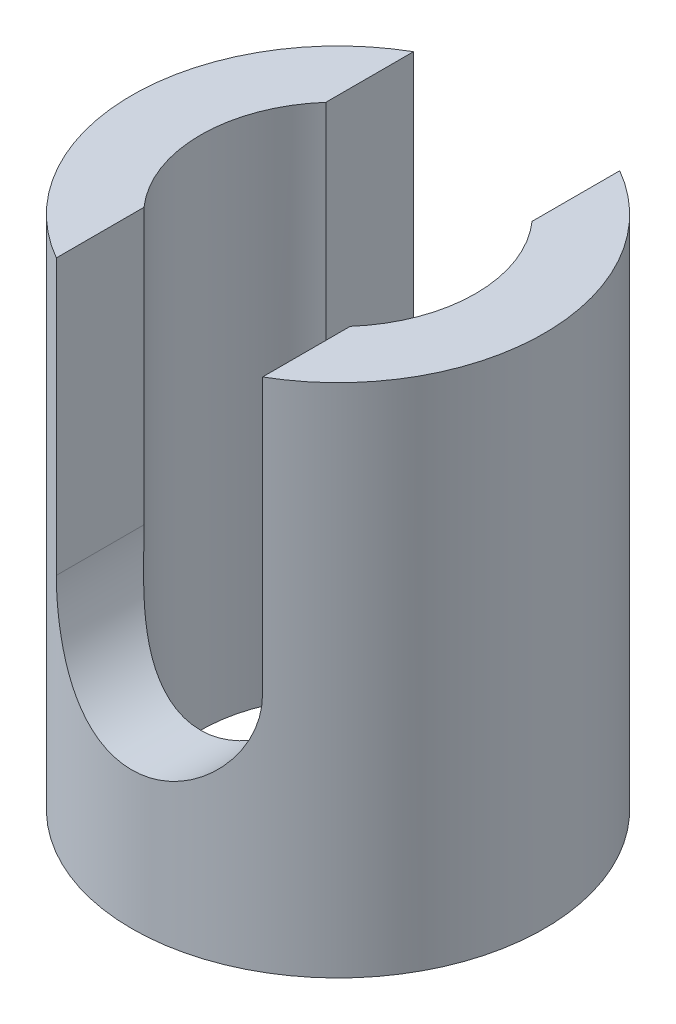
ISO-10303-21;
HEADER;
FILE_DESCRIPTION(('STEP AP214'),'2;1');
FILE_NAME('part.step','',(''),(''),'','','');
FILE_SCHEMA(('AUTOMOTIVE_DESIGN { 1 0 10303 214 1 1 1 1 }'));
ENDSEC;
DATA;
#1=APPLICATION_CONTEXT('core data for automotive mechanical design processes');
#2=APPLICATION_PROTOCOL_DEFINITION('international standard','automotive_design',2000,#1);
#3=PRODUCT_CONTEXT('',#1,'mechanical');
#4=PRODUCT('Part','Part','',(#3));
#5=PRODUCT_RELATED_PRODUCT_CATEGORY('part','',(#4));
#6=PRODUCT_DEFINITION_FORMATION('','',#4);
#7=PRODUCT_DEFINITION_CONTEXT('part definition',#1,'design');
#8=PRODUCT_DEFINITION('design','',#6,#7);
#9=PRODUCT_DEFINITION_SHAPE('','',#8);
#10=(LENGTH_UNIT() NAMED_UNIT(*) SI_UNIT(.MILLI.,.METRE.));
#11=(NAMED_UNIT(*) PLANE_ANGLE_UNIT() SI_UNIT($,.RADIAN.));
#12=(NAMED_UNIT(*) SI_UNIT($,.STERADIAN.) SOLID_ANGLE_UNIT());
#13=UNCERTAINTY_MEASURE_WITH_UNIT(LENGTH_MEASURE(1.E-05),#10,'distance_accuracy_value','');
#14=(GEOMETRIC_REPRESENTATION_CONTEXT(3) GLOBAL_UNCERTAINTY_ASSIGNED_CONTEXT((#13)) GLOBAL_UNIT_ASSIGNED_CONTEXT((#10,
#11,#12)) REPRESENTATION_CONTEXT('',''));
#15=CARTESIAN_POINT('',(0.,0.,0.));
#16=DIRECTION('',(0.,0.,1.));
#17=DIRECTION('',(1.,0.,0.));
#18=AXIS2_PLACEMENT_3D('',#15,#16,#17);
#19=CARTESIAN_POINT('',(0.,75.,0.));
#20=DIRECTION('',(0.,1.,0.));
#21=DIRECTION('',(0.,0.,1.));
#22=AXIS2_PLACEMENT_3D('',#19,#20,#21);
#23=PLANE('',#22);
#24=DIRECTION('',(0.,0.,1.));
#25=VECTOR('',#24,1.);
#26=CARTESIAN_POINT('',(15.,75.,-45.));
#27=LINE('',#26,#25);
#28=CARTESIAN_POINT('',(15.,75.,13.2287565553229));
#29=VERTEX_POINT('',#28);
#30=CARTESIAN_POINT('',(15.,75.,25.9807621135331));
#31=VERTEX_POINT('',#30);
#32=EDGE_CURVE('E269',#29,#31,#27,.T.);
#33=ORIENTED_EDGE('',*,*,#32,.T.);
#34=CARTESIAN_POINT('',(0.,75.,0.));
#35=DIRECTION('',(0.,1.,0.));
#36=DIRECTION('',(0.,0.,1.));
#37=AXIS2_PLACEMENT_3D('',#34,#35,#36);
#38=CIRCLE('',#37,30.);
#39=CARTESIAN_POINT('',(15.,75.,-25.9807621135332));
#40=VERTEX_POINT('',#39);
#41=EDGE_CURVE('E117',#31,#40,#38,.T.);
#42=ORIENTED_EDGE('',*,*,#41,.T.);
#43=CARTESIAN_POINT('',(15.,75.,-13.228756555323));
#44=VERTEX_POINT('',#43);
#45=EDGE_CURVE('E273',#40,#44,#27,.T.);
#46=ORIENTED_EDGE('',*,*,#45,.T.);
#47=CARTESIAN_POINT('',(0.,75.,0.));
#48=DIRECTION('',(0.,1.,0.));
#49=DIRECTION('',(0.,0.,1.));
#50=AXIS2_PLACEMENT_3D('',#47,#48,#49);
#51=CIRCLE('',#50,20.);
#52=EDGE_CURVE('E123',#29,#44,#51,.T.);
#53=ORIENTED_EDGE('',*,*,#52,.F.);
#54=EDGE_LOOP('',(#33,#42,#46,#53));
#55=FACE_BOUND('',#54,.T.);
#56=ADVANCED_FACE('F30',(#55),#23,.T.);
#57=DIRECTION('',(0.,0.,1.));
#58=VECTOR('',#57,1.);
#59=CARTESIAN_POINT('',(-15.,75.,-45.));
#60=LINE('',#59,#58);
#61=CARTESIAN_POINT('',(-15.,75.,-25.9807621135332));
#62=VERTEX_POINT('',#61);
#63=CARTESIAN_POINT('',(-15.,75.,-13.2287565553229));
#64=VERTEX_POINT('',#63);
#65=EDGE_CURVE('E54',#62,#64,#60,.T.);
#66=ORIENTED_EDGE('',*,*,#65,.F.);
#67=CARTESIAN_POINT('',(-15.,75.,25.9807621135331));
#68=VERTEX_POINT('',#67);
#69=EDGE_CURVE('E109',#62,#68,#38,.T.);
#70=ORIENTED_EDGE('',*,*,#69,.T.);
#71=CARTESIAN_POINT('',(-15.,75.,13.2287565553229));
#72=VERTEX_POINT('',#71);
#73=EDGE_CURVE('E112',#72,#68,#60,.T.);
#74=ORIENTED_EDGE('',*,*,#73,.F.);
#75=EDGE_CURVE('E111',#64,#72,#51,.T.);
#76=ORIENTED_EDGE('',*,*,#75,.F.);
#77=EDGE_LOOP('',(#66,#70,#74,#76));
#78=FACE_BOUND('',#77,.T.);
#79=ADVANCED_FACE('F107',(#78),#23,.T.);
#80=CARTESIAN_POINT('',(0.,0.,0.));
#81=DIRECTION('',(0.,1.,0.));
#82=DIRECTION('',(0.,0.,1.));
#83=AXIS2_PLACEMENT_3D('',#80,#81,#82);
#84=PLANE('',#83);
#85=CARTESIAN_POINT('',(0.,0.,0.));
#86=DIRECTION('',(0.,1.,0.));
#87=DIRECTION('',(0.,0.,1.));
#88=AXIS2_PLACEMENT_3D('',#85,#86,#87);
#89=CIRCLE('',#88,30.);
#90=CARTESIAN_POINT('',(0.,0.,30.));
#91=VERTEX_POINT('',#90);
#92=EDGE_CURVE('E118',#91,#91,#89,.T.);
#93=ORIENTED_EDGE('',*,*,#92,.F.);
#94=EDGE_LOOP('',(#93));
#95=FACE_BOUND('',#94,.T.);
#96=CARTESIAN_POINT('',(0.,0.,0.));
#97=DIRECTION('',(0.,1.,0.));
#98=DIRECTION('',(0.,0.,1.));
#99=AXIS2_PLACEMENT_3D('',#96,#97,#98);
#100=CIRCLE('',#99,20.);
#101=CARTESIAN_POINT('',(0.,0.,20.));
#102=VERTEX_POINT('',#101);
#103=EDGE_CURVE('E126',#102,#102,#100,.T.);
#104=ORIENTED_EDGE('',*,*,#103,.T.);
#105=EDGE_LOOP('',(#104));
#106=FACE_BOUND('',#105,.T.);
#107=ADVANCED_FACE('F182',(#95,#106),#84,.F.);
#108=CARTESIAN_POINT('',(0.,75.,0.));
#109=DIRECTION('',(0.,-1.,0.));
#110=DIRECTION('',(0.,0.,-1.));
#111=AXIS2_PLACEMENT_3D('',#108,#109,#110);
#112=CYLINDRICAL_SURFACE('',#111,30.);
#113=CARTESIAN_POINT('',(-15.,35.,-25.9807621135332));
#114=CARTESIAN_POINT('',(-15.0000014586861,34.8035788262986,-25.9807576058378));
#115=CARTESIAN_POINT('',(-14.9961410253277,34.6071854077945,-25.9829905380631));
#116=CARTESIAN_POINT('',(-14.9807217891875,34.2148095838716,-25.9918850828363));
#117=CARTESIAN_POINT('',(-14.96916331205,34.0188271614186,-25.9985465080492));
#118=CARTESIAN_POINT('',(-14.9230045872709,33.4323368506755,-26.0250894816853));
#119=CARTESIAN_POINT('',(-14.8769209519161,33.0429511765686,-26.0515298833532));
#120=CARTESIAN_POINT('',(-14.7551046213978,32.2727063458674,-26.1207142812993));
#121=CARTESIAN_POINT('',(-14.6795433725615,31.891811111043,-26.1633639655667));
#122=CARTESIAN_POINT('',(-14.4996932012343,31.1388163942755,-26.2634626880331));
#123=CARTESIAN_POINT('',(-14.3954009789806,30.7667179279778,-26.3209134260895));
#124=CARTESIAN_POINT('',(-14.1594990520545,30.0344949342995,-26.4485633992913));
#125=CARTESIAN_POINT('',(-14.0279498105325,29.6743459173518,-26.518734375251));
#126=CARTESIAN_POINT('',(-13.7386324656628,28.9670930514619,-26.6697691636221));
#127=CARTESIAN_POINT('',(-13.5808646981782,28.6199890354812,-26.7506328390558));
#128=CARTESIAN_POINT('',(-13.2401344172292,27.939995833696,-26.9209053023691));
#129=CARTESIAN_POINT('',(-13.0571396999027,27.607125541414,-27.0103249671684));
#130=CARTESIAN_POINT('',(-12.667252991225,26.9573433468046,-27.1953538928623));
#131=CARTESIAN_POINT('',(-12.4603522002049,26.640437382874,-27.2909654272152));
#132=CARTESIAN_POINT('',(-12.0060202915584,25.9987571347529,-27.4940416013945));
#133=CARTESIAN_POINT('',(-11.7566593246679,25.6754524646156,-27.6018366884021));
#134=CARTESIAN_POINT('',(-11.2327527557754,25.0505512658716,-27.819160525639));
#135=CARTESIAN_POINT('',(-10.9582058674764,24.7489558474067,-27.9286893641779));
#136=CARTESIAN_POINT('',(-10.3851551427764,24.1688018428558,-28.14680386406));
#137=CARTESIAN_POINT('',(-10.0866411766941,23.8902530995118,-28.2553891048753));
#138=CARTESIAN_POINT('',(-9.46725117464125,23.3579273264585,-28.4689028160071));
#139=CARTESIAN_POINT('',(-9.14638268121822,23.1041420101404,-28.5738325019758));
#140=CARTESIAN_POINT('',(-8.46116294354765,22.6064548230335,-28.7844701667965));
#141=CARTESIAN_POINT('',(-8.09533855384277,22.3643930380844,-28.8897475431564));
#142=CARTESIAN_POINT('',(-7.34182448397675,21.912193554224,-29.0903697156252));
#143=CARTESIAN_POINT('',(-6.95413354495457,21.7020576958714,-29.1857139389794));
#144=CARTESIAN_POINT('',(-6.15953553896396,21.315880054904,-29.3636813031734));
#145=CARTESIAN_POINT('',(-5.75263775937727,21.1398219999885,-29.4463105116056));
#146=CARTESIAN_POINT('',(-4.92239251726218,20.82370659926,-29.5964174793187));
#147=CARTESIAN_POINT('',(-4.49904680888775,20.6836454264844,-29.663896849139));
#148=CARTESIAN_POINT('',(-3.66992752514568,20.4499577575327,-29.7774087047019));
#149=CARTESIAN_POINT('',(-3.2650467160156,20.3537365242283,-29.8246255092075));
#150=CARTESIAN_POINT('',(-2.4471632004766,20.1951063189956,-29.9028443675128));
#151=CARTESIAN_POINT('',(-2.03416084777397,20.1326958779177,-29.9338471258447));
#152=CARTESIAN_POINT('',(-1.20366828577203,20.0425415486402,-29.9787263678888));
#153=CARTESIAN_POINT('',(-0.786180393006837,20.0147805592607,-29.9926113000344));
#154=CARTESIAN_POINT('',(0.0498593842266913,19.9942569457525,-30.0028704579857));
#155=CARTESIAN_POINT('',(0.468411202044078,20.0014921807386,-29.999245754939));
#156=CARTESIAN_POINT('',(1.26655168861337,20.0486961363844,-29.9756757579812));
#157=CARTESIAN_POINT('',(1.64635933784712,20.0857594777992,-29.9571791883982));
#158=CARTESIAN_POINT('',(2.40109782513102,20.1885262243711,-29.9061492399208));
#159=CARTESIAN_POINT('',(2.77602900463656,20.254227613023,-29.8736168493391));
#160=CARTESIAN_POINT('',(3.51848760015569,20.4135535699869,-29.7952951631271));
#161=CARTESIAN_POINT('',(3.88601491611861,20.5071785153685,-29.749505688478));
#162=CARTESIAN_POINT('',(4.61135394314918,20.7213995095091,-29.6457358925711));
#163=CARTESIAN_POINT('',(4.96916530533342,20.8419965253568,-29.5877551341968));
#164=CARTESIAN_POINT('',(5.67784399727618,21.110878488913,-29.4600324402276));
#165=CARTESIAN_POINT('',(6.02854798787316,21.2595216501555,-29.3901396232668));
#166=CARTESIAN_POINT('',(6.71596535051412,21.5821024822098,-29.2407172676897));
#167=CARTESIAN_POINT('',(7.05267873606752,21.7560401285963,-29.1611877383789));
#168=CARTESIAN_POINT('',(7.7105448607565,22.1279259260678,-28.9941837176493));
#169=CARTESIAN_POINT('',(8.03169592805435,22.3258766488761,-28.9067083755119));
#170=CARTESIAN_POINT('',(8.65712479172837,22.7445573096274,-28.725602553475));
#171=CARTESIAN_POINT('',(8.9613959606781,22.9652960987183,-28.6319696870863));
#172=CARTESIAN_POINT('',(9.57956834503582,23.4500925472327,-28.4314467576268));
#173=CARTESIAN_POINT('',(9.89167201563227,23.7162722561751,-28.3241391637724));
#174=CARTESIAN_POINT('',(10.4926149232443,24.2728021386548,-28.1070653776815));
#175=CARTESIAN_POINT('',(10.7814528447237,24.5631536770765,-27.9972990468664));
#176=CARTESIAN_POINT('',(11.3347011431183,25.16677644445,-27.7779260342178));
#177=CARTESIAN_POINT('',(11.5990922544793,25.4800654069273,-27.6683195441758));
#178=CARTESIAN_POINT('',(12.1018557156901,26.1279508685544,-27.4521400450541));
#179=CARTESIAN_POINT('',(12.3402233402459,26.4625512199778,-27.3455675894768));
#180=CARTESIAN_POINT('',(12.8039610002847,27.1737482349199,-27.1316776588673));
#181=CARTESIAN_POINT('',(13.0275001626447,27.5516616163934,-27.0247557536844));
#182=CARTESIAN_POINT('',(13.4414723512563,28.3276622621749,-26.8212607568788));
#183=CARTESIAN_POINT('',(13.6319207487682,28.7257400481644,-26.7246828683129));
#184=CARTESIAN_POINT('',(13.977598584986,29.5390802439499,-26.5455193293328));
#185=CARTESIAN_POINT('',(14.1328910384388,29.954310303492,-26.4629087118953));
#186=CARTESIAN_POINT('',(14.4067274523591,30.7995998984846,-26.3148344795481));
#187=CARTESIAN_POINT('',(14.5252873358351,31.2296529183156,-26.2493634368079));
#188=CARTESIAN_POINT('',(14.686571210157,31.9369371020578,-26.1593117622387));
#189=CARTESIAN_POINT('',(14.7410435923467,32.210774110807,-26.1286151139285));
#190=CARTESIAN_POINT('',(14.8347061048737,32.7617981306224,-26.0755516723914));
#191=CARTESIAN_POINT('',(14.8739004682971,33.0389841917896,-26.0531825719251));
#192=CARTESIAN_POINT('',(14.9367976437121,33.5961564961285,-26.0171763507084));
#193=CARTESIAN_POINT('',(14.9604736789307,33.8761467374,-26.0035543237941));
#194=CARTESIAN_POINT('',(14.9920878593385,34.4374199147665,-25.9853296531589));
#195=CARTESIAN_POINT('',(15.000019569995,34.7187033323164,-25.9807306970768));
#196=CARTESIAN_POINT('',(15.,35.,-25.9807621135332));
#197=B_SPLINE_CURVE_WITH_KNOTS('',3,(#113,#114,#115,#116,#117,#118,#119,#120,#121,#122,#123,
#124,#125,#126,#127,#128,#129,#130,#131,#132,#133,#134,#135,#136,#137,#138,#139,#140,#141,#142,
#143,#144,#145,#146,#147,#148,#149,#150,#151,#152,#153,#154,#155,#156,#157,#158,#159,#160,#161,
#162,#163,#164,#165,#166,#167,#168,#169,#170,#171,#172,#173,#174,#175,#176,#177,#178,#179,#180,
#181,#182,#183,#184,#185,#186,#187,#188,#189,#190,#191,#192,#193,#194,#195,#196),.UNSPECIFIED.,
.F.,.F.,(4,2,2,2,2,2,2,2,2,2,2,2,2,2,2,2,2,2,2,2,2,2,2,2,2,2,2,2,2,2,2,2,2,2,2,2,2,2,2,2,2,4),
(0.,0.589158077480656,1.17829123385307,2.3555570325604,3.5260753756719,4.69672820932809,
5.86481151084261,7.03287985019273,8.20245335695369,9.37245875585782,10.6379774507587,
11.9035608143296,13.1696819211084,14.4353778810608,15.7869844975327,17.1386690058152,
18.4897064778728,19.8406002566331,21.0953807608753,22.350106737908,23.6042132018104,
24.858242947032,26.0030687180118,27.1478138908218,28.2925745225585,29.4373762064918,
30.5979332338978,31.7584891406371,32.9191694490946,34.0803022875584,35.3509282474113,
36.6216260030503,37.8933167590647,39.1652380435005,40.5192232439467,41.8725778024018,
43.2234870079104,44.5738097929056,45.4159682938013,46.2578932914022,47.101267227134,
47.9449857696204),.UNSPECIFIED.);
#198=CARTESIAN_POINT('',(-15.,35.,-25.9807621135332));
#199=VERTEX_POINT('',#198);
#200=CARTESIAN_POINT('',(15.,35.,-25.9807621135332));
#201=VERTEX_POINT('',#200);
#202=EDGE_CURVE('E101',#199,#201,#197,.T.);
#203=ORIENTED_EDGE('',*,*,#202,.T.);
#204=DIRECTION('',(0.,-1.,0.));
#205=VECTOR('',#204,1.);
#206=CARTESIAN_POINT('',(15.,75.,-25.9807621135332));
#207=LINE('',#206,#205);
#208=EDGE_CURVE('E168',#201,#40,#207,.F.);
#209=ORIENTED_EDGE('',*,*,#208,.T.);
#210=ORIENTED_EDGE('',*,*,#41,.F.);
#211=DIRECTION('',(0.,-1.,0.));
#212=VECTOR('',#211,1.);
#213=CARTESIAN_POINT('',(15.,75.,25.9807621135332));
#214=LINE('',#213,#212);
#215=CARTESIAN_POINT('',(15.,35.,25.9807621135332));
#216=VERTEX_POINT('',#215);
#217=EDGE_CURVE('E171',#31,#216,#214,.T.);
#218=ORIENTED_EDGE('',*,*,#217,.T.);
#219=CARTESIAN_POINT('',(15.,35.,25.9807621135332));
#220=CARTESIAN_POINT('',(15.0000014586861,34.8035788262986,25.9807576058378));
#221=CARTESIAN_POINT('',(14.9961410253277,34.6071854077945,25.9829905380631));
#222=CARTESIAN_POINT('',(14.9807217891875,34.2148095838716,25.9918850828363));
#223=CARTESIAN_POINT('',(14.96916331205,34.0188271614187,25.9985465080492));
#224=CARTESIAN_POINT('',(14.9230045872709,33.4323368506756,26.0250894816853));
#225=CARTESIAN_POINT('',(14.8769209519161,33.0429511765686,26.0515298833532));
#226=CARTESIAN_POINT('',(14.7551046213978,32.2727063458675,26.1207142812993));
#227=CARTESIAN_POINT('',(14.6795433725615,31.891811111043,26.1633639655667));
#228=CARTESIAN_POINT('',(14.4996932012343,31.1388163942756,26.2634626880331));
#229=CARTESIAN_POINT('',(14.3954009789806,30.7667179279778,26.3209134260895));
#230=CARTESIAN_POINT('',(14.1594990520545,30.0344949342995,26.4485633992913));
#231=CARTESIAN_POINT('',(14.0279498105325,29.6743459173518,26.518734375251));
#232=CARTESIAN_POINT('',(13.7386324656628,28.9670930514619,26.6697691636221));
#233=CARTESIAN_POINT('',(13.5808646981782,28.6199890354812,26.7506328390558));
#234=CARTESIAN_POINT('',(13.2401344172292,27.939995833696,26.9209053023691));
#235=CARTESIAN_POINT('',(13.0571396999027,27.607125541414,27.0103249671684));
#236=CARTESIAN_POINT('',(12.6672529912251,26.9573433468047,27.1953538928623));
#237=CARTESIAN_POINT('',(12.4603522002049,26.6404373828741,27.2909654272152));
#238=CARTESIAN_POINT('',(12.0060202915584,25.9987571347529,27.4940416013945));
#239=CARTESIAN_POINT('',(11.7566593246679,25.6754524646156,27.6018366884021));
#240=CARTESIAN_POINT('',(11.2327527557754,25.0505512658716,27.819160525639));
#241=CARTESIAN_POINT('',(10.9582058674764,24.7489558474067,27.9286893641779));
#242=CARTESIAN_POINT('',(10.3851551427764,24.1688018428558,28.14680386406));
#243=CARTESIAN_POINT('',(10.0866411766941,23.8902530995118,28.2553891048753));
#244=CARTESIAN_POINT('',(9.46725117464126,23.3579273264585,28.4689028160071));
#245=CARTESIAN_POINT('',(9.14638268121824,23.1041420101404,28.5738325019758));
#246=CARTESIAN_POINT('',(8.46116294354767,22.6064548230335,28.7844701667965));
#247=CARTESIAN_POINT('',(8.09533855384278,22.3643930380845,28.8897475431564));
#248=CARTESIAN_POINT('',(7.34182448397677,21.912193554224,29.0903697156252));
#249=CARTESIAN_POINT('',(6.95413354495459,21.7020576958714,29.1857139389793));
#250=CARTESIAN_POINT('',(6.15953553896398,21.3158800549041,29.3636813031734));
#251=CARTESIAN_POINT('',(5.75263775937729,21.1398219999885,29.4463105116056));
#252=CARTESIAN_POINT('',(4.9223925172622,20.82370659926,29.5964174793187));
#253=CARTESIAN_POINT('',(4.49904680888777,20.6836454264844,29.663896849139));
#254=CARTESIAN_POINT('',(3.6699275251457,20.4499577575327,29.7774087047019));
#255=CARTESIAN_POINT('',(3.26504671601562,20.3537365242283,29.8246255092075));
#256=CARTESIAN_POINT('',(2.44716320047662,20.1951063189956,29.9028443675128));
#257=CARTESIAN_POINT('',(2.03416084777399,20.1326958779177,29.9338471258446));
#258=CARTESIAN_POINT('',(1.20366828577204,20.0425415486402,29.9787263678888));
#259=CARTESIAN_POINT('',(0.786180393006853,20.0147805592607,29.9926113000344));
#260=CARTESIAN_POINT('',(-0.0498593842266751,19.9942569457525,30.0028704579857));
#261=CARTESIAN_POINT('',(-0.468411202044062,20.0014921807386,29.999245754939));
#262=CARTESIAN_POINT('',(-1.26655168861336,20.0486961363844,29.9756757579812));
#263=CARTESIAN_POINT('',(-1.6463593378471,20.0857594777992,29.9571791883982));
#264=CARTESIAN_POINT('',(-2.401097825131,20.1885262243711,29.9061492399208));
#265=CARTESIAN_POINT('',(-2.77602900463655,20.254227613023,29.8736168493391));
#266=CARTESIAN_POINT('',(-3.51848760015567,20.4135535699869,29.7952951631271));
#267=CARTESIAN_POINT('',(-3.8860149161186,20.5071785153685,29.749505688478));
#268=CARTESIAN_POINT('',(-4.61135394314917,20.7213995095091,29.6457358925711));
#269=CARTESIAN_POINT('',(-4.96916530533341,20.8419965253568,29.5877551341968));
#270=CARTESIAN_POINT('',(-5.67784399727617,21.110878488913,29.4600324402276));
#271=CARTESIAN_POINT('',(-6.02854798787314,21.2595216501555,29.3901396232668));
#272=CARTESIAN_POINT('',(-6.71596535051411,21.5821024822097,29.2407172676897));
#273=CARTESIAN_POINT('',(-7.05267873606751,21.7560401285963,29.1611877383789));
#274=CARTESIAN_POINT('',(-7.7105448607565,22.1279259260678,28.9941837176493));
#275=CARTESIAN_POINT('',(-8.03169592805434,22.3258766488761,28.906708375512));
#276=CARTESIAN_POINT('',(-8.65712479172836,22.7445573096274,28.725602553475));
#277=CARTESIAN_POINT('',(-8.96139596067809,22.9652960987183,28.6319696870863));
#278=CARTESIAN_POINT('',(-9.5795683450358,23.4500925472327,28.4314467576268));
#279=CARTESIAN_POINT('',(-9.89167201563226,23.7162722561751,28.3241391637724));
#280=CARTESIAN_POINT('',(-10.4926149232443,24.2728021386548,28.1070653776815));
#281=CARTESIAN_POINT('',(-10.7814528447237,24.5631536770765,27.9972990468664));
#282=CARTESIAN_POINT('',(-11.3347011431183,25.16677644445,27.7779260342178));
#283=CARTESIAN_POINT('',(-11.5990922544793,25.4800654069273,27.6683195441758));
#284=CARTESIAN_POINT('',(-12.1018557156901,26.1279508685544,27.4521400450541));
#285=CARTESIAN_POINT('',(-12.3402233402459,26.4625512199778,27.3455675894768));
#286=CARTESIAN_POINT('',(-12.8039610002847,27.1737482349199,27.1316776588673));
#287=CARTESIAN_POINT('',(-13.0275001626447,27.5516616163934,27.0247557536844));
#288=CARTESIAN_POINT('',(-13.4414723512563,28.3276622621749,26.8212607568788));
#289=CARTESIAN_POINT('',(-13.6319207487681,28.7257400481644,26.7246828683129));
#290=CARTESIAN_POINT('',(-13.977598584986,29.5390802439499,26.5455193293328));
#291=CARTESIAN_POINT('',(-14.1328910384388,29.954310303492,26.4629087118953));
#292=CARTESIAN_POINT('',(-14.4067274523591,30.7995998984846,26.3148344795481));
#293=CARTESIAN_POINT('',(-14.5252873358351,31.2296529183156,26.2493634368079));
#294=CARTESIAN_POINT('',(-14.686571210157,31.9369371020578,26.1593117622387));
#295=CARTESIAN_POINT('',(-14.7410435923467,32.210774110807,26.1286151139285));
#296=CARTESIAN_POINT('',(-14.8347061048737,32.7617981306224,26.0755516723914));
#297=CARTESIAN_POINT('',(-14.8739004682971,33.0389841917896,26.0531825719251));
#298=CARTESIAN_POINT('',(-14.9367976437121,33.5961564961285,26.0171763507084));
#299=CARTESIAN_POINT('',(-14.9604736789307,33.8761467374,26.0035543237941));
#300=CARTESIAN_POINT('',(-14.9920878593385,34.4374199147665,25.9853296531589));
#301=CARTESIAN_POINT('',(-15.000019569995,34.7187033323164,25.9807306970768));
#302=CARTESIAN_POINT('',(-15.,35.,25.9807621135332));
#303=B_SPLINE_CURVE_WITH_KNOTS('',3,(#219,#220,#221,#222,#223,#224,#225,#226,#227,#228,#229,
#230,#231,#232,#233,#234,#235,#236,#237,#238,#239,#240,#241,#242,#243,#244,#245,#246,#247,#248,
#249,#250,#251,#252,#253,#254,#255,#256,#257,#258,#259,#260,#261,#262,#263,#264,#265,#266,#267,
#268,#269,#270,#271,#272,#273,#274,#275,#276,#277,#278,#279,#280,#281,#282,#283,#284,#285,#286,
#287,#288,#289,#290,#291,#292,#293,#294,#295,#296,#297,#298,#299,#300,#301,#302),.UNSPECIFIED.,
.F.,.F.,(4,2,2,2,2,2,2,2,2,2,2,2,2,2,2,2,2,2,2,2,2,2,2,2,2,2,2,2,2,2,2,2,2,2,2,2,2,2,2,2,2,4),
(0.,0.589158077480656,1.17829123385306,2.35555703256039,3.52607537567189,4.69672820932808,
5.86481151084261,7.03287985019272,8.20245335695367,9.3724587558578,10.6379774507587,
11.9035608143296,13.1696819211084,14.4353778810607,15.7869844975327,17.1386690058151,
18.4897064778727,19.8406002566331,21.0953807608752,22.350106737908,23.6042132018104,
24.8582429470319,26.0030687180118,27.1478138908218,28.2925745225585,29.4373762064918,
30.5979332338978,31.7584891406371,32.9191694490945,34.0803022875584,35.3509282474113,
36.6216260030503,37.8933167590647,39.1652380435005,40.5192232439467,41.8725778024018,
43.2234870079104,44.5738097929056,45.4159682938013,46.2578932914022,47.101267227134,
47.9449857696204),.UNSPECIFIED.);
#304=CARTESIAN_POINT('',(-15.,35.,25.9807621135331));
#305=VERTEX_POINT('',#304);
#306=EDGE_CURVE('E162',#216,#305,#303,.T.);
#307=ORIENTED_EDGE('',*,*,#306,.T.);
#308=DIRECTION('',(0.,-1.,0.));
#309=VECTOR('',#308,1.);
#310=CARTESIAN_POINT('',(-15.,75.,25.9807621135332));
#311=LINE('',#310,#309);
#312=EDGE_CURVE('E102',#305,#68,#311,.F.);
#313=ORIENTED_EDGE('',*,*,#312,.T.);
#314=ORIENTED_EDGE('',*,*,#69,.F.);
#315=DIRECTION('',(0.,-1.,0.));
#316=VECTOR('',#315,1.);
#317=CARTESIAN_POINT('',(-15.,75.,-25.9807621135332));
#318=LINE('',#317,#316);
#319=EDGE_CURVE('E94',#62,#199,#318,.T.);
#320=ORIENTED_EDGE('',*,*,#319,.T.);
#321=EDGE_LOOP('',(#203,#209,#210,#218,#307,#313,#314,#320));
#322=FACE_BOUND('',#321,.T.);
#323=ORIENTED_EDGE('',*,*,#92,.T.);
#324=EDGE_LOOP('',(#323));
#325=FACE_BOUND('',#324,.T.);
#326=ADVANCED_FACE('F32',(#322,#325),#112,.T.);
#327=CARTESIAN_POINT('',(0.,75.,0.));
#328=DIRECTION('',(0.,-1.,0.));
#329=DIRECTION('',(0.,0.,-1.));
#330=AXIS2_PLACEMENT_3D('',#327,#328,#329);
#331=CYLINDRICAL_SURFACE('',#330,20.);
#332=DIRECTION('',(0.,-1.,0.));
#333=VECTOR('',#332,1.);
#334=CARTESIAN_POINT('',(15.,75.,-13.2287565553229));
#335=LINE('',#334,#333);
#336=CARTESIAN_POINT('',(15.,35.,-13.228756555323));
#337=VERTEX_POINT('',#336);
#338=EDGE_CURVE('E11',#337,#44,#335,.F.);
#339=ORIENTED_EDGE('',*,*,#338,.F.);
#340=CARTESIAN_POINT('',(-15.,35.,-13.228756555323));
#341=CARTESIAN_POINT('',(-15.0000079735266,34.8232661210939,-13.2287370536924));
#342=CARTESIAN_POINT('',(-14.99687673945,34.6465401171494,-13.2322977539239));
#343=CARTESIAN_POINT('',(-14.9843963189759,34.293617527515,-13.246434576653));
#344=CARTESIAN_POINT('',(-14.9750481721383,34.1174208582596,-13.2570095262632));
#345=CARTESIAN_POINT('',(-14.9502196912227,33.7663694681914,-13.2850013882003));
#346=CARTESIAN_POINT('',(-14.9347519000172,33.5915127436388,-13.3024043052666));
#347=CARTESIAN_POINT('',(-14.897799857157,33.2432296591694,-13.3437747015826));
#348=CARTESIAN_POINT('',(-14.8763154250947,33.0698033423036,-13.3677423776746));
#349=CARTESIAN_POINT('',(-14.8036672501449,32.5567178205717,-13.44829677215));
#350=CARTESIAN_POINT('',(-14.7439736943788,32.2196177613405,-13.5139214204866));
#351=CARTESIAN_POINT('',(-14.6029534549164,31.5548005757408,-13.6661791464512));
#352=CARTESIAN_POINT('',(-14.5216163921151,31.2270880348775,-13.7528223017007));
#353=CARTESIAN_POINT('',(-14.3394542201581,30.5852010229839,-13.9426395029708));
#354=CARTESIAN_POINT('',(-14.2387925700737,30.2709382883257,-14.0456737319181));
#355=CARTESIAN_POINT('',(-14.0188186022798,29.6539730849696,-14.2652324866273));
#356=CARTESIAN_POINT('',(-13.8995081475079,29.3512694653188,-14.3817556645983));
#357=CARTESIAN_POINT('',(-13.6428058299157,28.7566767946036,-14.6255010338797));
#358=CARTESIAN_POINT('',(-13.5053514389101,28.4648298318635,-14.7527596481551));
#359=CARTESIAN_POINT('',(-13.2134890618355,27.8931922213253,-15.0147320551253));
#360=CARTESIAN_POINT('',(-13.0590784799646,27.6134034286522,-15.1494469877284));
#361=CARTESIAN_POINT('',(-12.7001495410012,27.0091277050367,-15.4522541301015));
#362=CARTESIAN_POINT('',(-12.4918843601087,26.6874237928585,-15.6214682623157));
#363=CARTESIAN_POINT('',(-12.052289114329,26.0619661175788,-15.9630777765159));
#364=CARTESIAN_POINT('',(-11.8209572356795,25.7582137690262,-16.1354734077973));
#365=CARTESIAN_POINT('',(-11.3356217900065,25.1689561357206,-16.4800573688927));
#366=CARTESIAN_POINT('',(-11.0816072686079,24.8834597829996,-16.6522455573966));
#367=CARTESIAN_POINT('',(-10.5513878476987,24.3316052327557,-16.9931630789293));
#368=CARTESIAN_POINT('',(-10.2751811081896,24.0652486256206,-17.1618921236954));
#369=CARTESIAN_POINT('',(-9.64205182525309,23.5001787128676,-17.5268442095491));
#370=CARTESIAN_POINT('',(-9.28018943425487,23.2060242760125,-17.7216135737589));
#371=CARTESIAN_POINT('',(-8.52559136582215,22.6495318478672,-18.0967360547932));
#372=CARTESIAN_POINT('',(-8.13284875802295,22.3872010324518,-18.2770859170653));
#373=CARTESIAN_POINT('',(-7.31872600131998,21.898039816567,-18.6180199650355));
#374=CARTESIAN_POINT('',(-6.8973966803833,21.6711486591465,-18.7786378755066));
#375=CARTESIAN_POINT('',(-6.02799667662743,21.256093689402,-19.0754795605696));
#376=CARTESIAN_POINT('',(-5.5799403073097,21.0679093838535,-19.2117162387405));
#377=CARTESIAN_POINT('',(-4.79953907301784,20.7844781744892,-19.4184126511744));
#378=CARTESIAN_POINT('',(-4.47307882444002,20.6783226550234,-19.4963154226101));
#379=CARTESIAN_POINT('',(-3.81057296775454,20.487997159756,-19.6365494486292));
#380=CARTESIAN_POINT('',(-3.4745296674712,20.4038219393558,-19.6988844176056));
#381=CARTESIAN_POINT('',(-2.79505763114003,20.2586206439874,-19.8067136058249));
#382=CARTESIAN_POINT('',(-2.45163414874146,20.1975786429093,-19.8522194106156));
#383=CARTESIAN_POINT('',(-1.75948027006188,20.0994498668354,-19.9254943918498));
#384=CARTESIAN_POINT('',(-1.41074968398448,20.0623639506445,-19.9532629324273));
#385=CARTESIAN_POINT('',(-0.709643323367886,20.012664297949,-19.9904967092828));
#386=CARTESIAN_POINT('',(-0.357260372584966,20.0001152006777,-19.9999136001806));
#387=CARTESIAN_POINT('',(0.34751686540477,19.9998863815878,-20.0000852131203));
#388=CARTESIAN_POINT('',(0.69991115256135,20.0122065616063,-19.9908400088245));
#389=CARTESIAN_POINT('',(1.4020550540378,20.0615217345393,-19.9538935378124));
#390=CARTESIAN_POINT('',(1.75180413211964,20.0985216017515,-19.9261886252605));
#391=CARTESIAN_POINT('',(2.44599532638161,20.196622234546,-19.8529325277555));
#392=CARTESIAN_POINT('',(2.7904374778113,20.2577228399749,-19.807381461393));
#393=CARTESIAN_POINT('',(3.45994572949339,20.4006198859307,-19.7012612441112));
#394=CARTESIAN_POINT('',(3.78527081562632,20.4816323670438,-19.6412624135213));
#395=CARTESIAN_POINT('',(4.42695679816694,20.6642636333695,-19.5066534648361));
#396=CARTESIAN_POINT('',(4.74331796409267,20.7658817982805,-19.4320437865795));
#397=CARTESIAN_POINT('',(5.36558937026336,20.9885877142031,-19.2695064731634));
#398=CARTESIAN_POINT('',(5.67149894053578,21.1096767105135,-19.1815779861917));
#399=CARTESIAN_POINT('',(6.27167491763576,21.3701380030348,-18.9938145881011));
#400=CARTESIAN_POINT('',(6.56593972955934,21.5095127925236,-18.8939780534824));
#401=CARTESIAN_POINT('',(7.17304449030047,21.8213751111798,-18.6725151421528));
#402=CARTESIAN_POINT('',(7.48444820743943,21.9958138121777,-18.5496999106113));
#403=CARTESIAN_POINT('',(8.09085688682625,22.3641808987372,-18.2933438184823));
#404=CARTESIAN_POINT('',(8.38586084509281,22.5581104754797,-18.1598023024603));
#405=CARTESIAN_POINT('',(8.9589942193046,22.9642261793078,-17.8840044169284));
#406=CARTESIAN_POINT('',(9.23711384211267,23.1764227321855,-17.7417430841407));
#407=CARTESIAN_POINT('',(9.77587473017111,23.6178394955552,-17.4506746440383));
#408=CARTESIAN_POINT('',(10.0365142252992,23.8470614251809,-17.301866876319));
#409=CARTESIAN_POINT('',(10.5894585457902,24.3682220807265,-16.970170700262));
#410=CARTESIAN_POINT('',(10.8779255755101,24.6636353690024,-16.7863299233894));
#411=CARTESIAN_POINT('',(11.4289306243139,25.2763505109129,-16.4161423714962));
#412=CARTESIAN_POINT('',(11.6914635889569,25.5936566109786,-16.2297951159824));
#413=CARTESIAN_POINT('',(12.1902786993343,26.2497361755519,-15.8585576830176));
#414=CARTESIAN_POINT('',(12.4265320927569,26.5885325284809,-15.6736693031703));
#415=CARTESIAN_POINT('',(12.8716274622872,27.2868551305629,-15.3102478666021));
#416=CARTESIAN_POINT('',(13.0804756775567,27.646376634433,-15.131713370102));
#417=CARTESIAN_POINT('',(13.4313823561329,28.3133912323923,-14.8203143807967));
#418=CARTESIAN_POINT('',(13.5785051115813,28.6172505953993,-14.6853626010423));
#419=CARTESIAN_POINT('',(13.8533906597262,29.2381582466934,-14.4263376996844));
#420=CARTESIAN_POINT('',(13.9811533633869,29.5552065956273,-14.3022646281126));
#421=CARTESIAN_POINT('',(14.2156000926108,30.2006195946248,-14.0692544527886));
#422=CARTESIAN_POINT('',(14.3223778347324,30.5289258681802,-13.9602507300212));
#423=CARTESIAN_POINT('',(14.514147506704,31.1973321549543,-13.7607666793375));
#424=CARTESIAN_POINT('',(14.5991462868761,31.5374284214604,-13.6702805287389));
#425=CARTESIAN_POINT('',(14.72578013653,32.1334353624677,-13.5335713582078));
#426=CARTESIAN_POINT('',(14.7729180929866,32.3869640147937,-13.4820092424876));
#427=CARTESIAN_POINT('',(14.8542996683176,32.8983814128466,-13.3922901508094));
#428=CARTESIAN_POINT('',(14.8885472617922,33.1562687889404,-13.3541290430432));
#429=CARTESIAN_POINT('',(14.9438987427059,33.677476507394,-13.2921683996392));
#430=CARTESIAN_POINT('',(14.9648860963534,33.9408245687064,-13.268496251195));
#431=CARTESIAN_POINT('',(14.9929628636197,34.4694313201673,-13.2367350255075));
#432=CARTESIAN_POINT('',(15.0000395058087,34.7346915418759,-13.2286602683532));
#433=CARTESIAN_POINT('',(15.,35.,-13.228756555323));
#434=B_SPLINE_CURVE_WITH_KNOTS('',3,(#340,#341,#342,#343,#344,#345,#346,#347,#348,#349,#350,
#351,#352,#353,#354,#355,#356,#357,#358,#359,#360,#361,#362,#363,#364,#365,#366,#367,#368,#369,
#370,#371,#372,#373,#374,#375,#376,#377,#378,#379,#380,#381,#382,#383,#384,#385,#386,#387,#388,
#389,#390,#391,#392,#393,#394,#395,#396,#397,#398,#399,#400,#401,#402,#403,#404,#405,#406,#407,
#408,#409,#410,#411,#412,#413,#414,#415,#416,#417,#418,#419,#420,#421,#422,#423,#424,#425,#426,
#427,#428,#429,#430,#431,#432,#433),.UNSPECIFIED.,.F.,.F.,(4,2,2,2,2,2,2,2,2,2,2,2,2,2,2,2,2,2,
2,2,2,2,2,2,2,2,2,2,2,2,2,2,2,2,2,2,2,2,2,2,2,2,2,2,2,2,4),(0.,0.530124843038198,
1.06016106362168,1.58911649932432,2.1180877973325,3.16210629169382,4.20662634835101,
5.24267226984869,6.27861476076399,7.31822539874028,8.35799541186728,9.61368105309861,
10.8694655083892,12.1258597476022,13.3823582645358,14.8964120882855,16.4108066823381,
17.9225758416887,19.4335425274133,20.4885392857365,21.5432840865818,22.5973014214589,
23.6513565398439,24.7081847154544,25.7650087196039,26.8220415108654,27.8790672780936,
28.8997433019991,29.920388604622,30.9410992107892,31.9619491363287,33.0932783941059,
34.2246768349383,35.3567253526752,36.4888883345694,37.8434598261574,39.198294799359,
40.5545978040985,41.9105914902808,43.0005068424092,44.090427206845,45.1753636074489,
46.2599583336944,47.048270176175,47.8363387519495,48.6312400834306,49.4268708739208),.UNSPECIFIED.);
#435=CARTESIAN_POINT('',(-15.,35.,-13.228756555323));
#436=VERTEX_POINT('',#435);
#437=EDGE_CURVE('E39',#436,#337,#434,.T.);
#438=ORIENTED_EDGE('',*,*,#437,.F.);
#439=DIRECTION('',(0.,-1.,0.));
#440=VECTOR('',#439,1.);
#441=CARTESIAN_POINT('',(-15.,75.,-13.2287565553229));
#442=LINE('',#441,#440);
#443=EDGE_CURVE('E266',#64,#436,#442,.T.);
#444=ORIENTED_EDGE('',*,*,#443,.F.);
#445=ORIENTED_EDGE('',*,*,#75,.T.);
#446=DIRECTION('',(0.,-1.,0.));
#447=VECTOR('',#446,1.);
#448=CARTESIAN_POINT('',(-15.,75.,13.2287565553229));
#449=LINE('',#448,#447);
#450=CARTESIAN_POINT('',(-15.,35.,13.2287565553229));
#451=VERTEX_POINT('',#450);
#452=EDGE_CURVE('E121',#451,#72,#449,.F.);
#453=ORIENTED_EDGE('',*,*,#452,.F.);
#454=CARTESIAN_POINT('',(15.,35.,13.2287565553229));
#455=CARTESIAN_POINT('',(15.0000079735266,34.8232661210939,13.2287370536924));
#456=CARTESIAN_POINT('',(14.99687673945,34.6465401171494,13.2322977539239));
#457=CARTESIAN_POINT('',(14.9843963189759,34.293617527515,13.246434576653));
#458=CARTESIAN_POINT('',(14.9750481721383,34.1174208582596,13.2570095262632));
#459=CARTESIAN_POINT('',(14.9502196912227,33.7663694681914,13.2850013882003));
#460=CARTESIAN_POINT('',(14.9347519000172,33.5915127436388,13.3024043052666));
#461=CARTESIAN_POINT('',(14.897799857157,33.2432296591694,13.3437747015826));
#462=CARTESIAN_POINT('',(14.8763154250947,33.0698033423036,13.3677423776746));
#463=CARTESIAN_POINT('',(14.8036672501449,32.5567178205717,13.44829677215));
#464=CARTESIAN_POINT('',(14.7439736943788,32.2196177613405,13.5139214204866));
#465=CARTESIAN_POINT('',(14.6029534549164,31.5548005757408,13.6661791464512));
#466=CARTESIAN_POINT('',(14.5216163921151,31.2270880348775,13.7528223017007));
#467=CARTESIAN_POINT('',(14.3394542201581,30.5852010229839,13.9426395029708));
#468=CARTESIAN_POINT('',(14.2387925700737,30.2709382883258,14.0456737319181));
#469=CARTESIAN_POINT('',(14.0188186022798,29.6539730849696,14.2652324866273));
#470=CARTESIAN_POINT('',(13.8995081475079,29.3512694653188,14.3817556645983));
#471=CARTESIAN_POINT('',(13.6428058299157,28.7566767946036,14.6255010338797));
#472=CARTESIAN_POINT('',(13.5053514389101,28.4648298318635,14.7527596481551));
#473=CARTESIAN_POINT('',(13.2134890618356,27.8931922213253,15.0147320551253));
#474=CARTESIAN_POINT('',(13.0590784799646,27.6134034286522,15.1494469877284));
#475=CARTESIAN_POINT('',(12.7001495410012,27.0091277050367,15.4522541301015));
#476=CARTESIAN_POINT('',(12.4918843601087,26.6874237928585,15.6214682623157));
#477=CARTESIAN_POINT('',(12.052289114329,26.0619661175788,15.9630777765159));
#478=CARTESIAN_POINT('',(11.8209572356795,25.7582137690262,16.1354734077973));
#479=CARTESIAN_POINT('',(11.3356217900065,25.1689561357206,16.4800573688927));
#480=CARTESIAN_POINT('',(11.0816072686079,24.8834597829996,16.6522455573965));
#481=CARTESIAN_POINT('',(10.5513878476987,24.3316052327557,16.9931630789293));
#482=CARTESIAN_POINT('',(10.2751811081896,24.0652486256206,17.1618921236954));
#483=CARTESIAN_POINT('',(9.6420518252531,23.5001787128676,17.526844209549));
#484=CARTESIAN_POINT('',(9.28018943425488,23.2060242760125,17.7216135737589));
#485=CARTESIAN_POINT('',(8.52559136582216,22.6495318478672,18.0967360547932));
#486=CARTESIAN_POINT('',(8.13284875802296,22.3872010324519,18.2770859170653));
#487=CARTESIAN_POINT('',(7.31872600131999,21.898039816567,18.6180199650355));
#488=CARTESIAN_POINT('',(6.89739668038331,21.6711486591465,18.7786378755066));
#489=CARTESIAN_POINT('',(6.02799667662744,21.256093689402,19.0754795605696));
#490=CARTESIAN_POINT('',(5.57994030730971,21.0679093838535,19.2117162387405));
#491=CARTESIAN_POINT('',(4.79953907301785,20.7844781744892,19.4184126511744));
#492=CARTESIAN_POINT('',(4.47307882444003,20.6783226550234,19.4963154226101));
#493=CARTESIAN_POINT('',(3.81057296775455,20.487997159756,19.6365494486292));
#494=CARTESIAN_POINT('',(3.47452966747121,20.4038219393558,19.6988844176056));
#495=CARTESIAN_POINT('',(2.79505763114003,20.2586206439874,19.8067136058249));
#496=CARTESIAN_POINT('',(2.45163414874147,20.1975786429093,19.8522194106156));
#497=CARTESIAN_POINT('',(1.75948027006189,20.0994498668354,19.9254943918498));
#498=CARTESIAN_POINT('',(1.41074968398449,20.0623639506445,19.9532629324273));
#499=CARTESIAN_POINT('',(0.709643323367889,20.012664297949,19.9904967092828));
#500=CARTESIAN_POINT('',(0.357260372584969,20.0001152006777,19.9999136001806));
#501=CARTESIAN_POINT('',(-0.347516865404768,19.9998863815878,20.0000852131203));
#502=CARTESIAN_POINT('',(-0.699911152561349,20.0122065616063,19.9908400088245));
#503=CARTESIAN_POINT('',(-1.4020550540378,20.0615217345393,19.9538935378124));
#504=CARTESIAN_POINT('',(-1.75180413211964,20.0985216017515,19.9261886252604));
#505=CARTESIAN_POINT('',(-2.44599532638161,20.196622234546,19.8529325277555));
#506=CARTESIAN_POINT('',(-2.79043747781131,20.2577228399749,19.807381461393));
#507=CARTESIAN_POINT('',(-3.4599457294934,20.4006198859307,19.7012612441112));
#508=CARTESIAN_POINT('',(-3.78527081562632,20.4816323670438,19.6412624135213));
#509=CARTESIAN_POINT('',(-4.42695679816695,20.6642636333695,19.5066534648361));
#510=CARTESIAN_POINT('',(-4.74331796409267,20.7658817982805,19.4320437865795));
#511=CARTESIAN_POINT('',(-5.36558937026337,20.9885877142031,19.2695064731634));
#512=CARTESIAN_POINT('',(-5.67149894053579,21.1096767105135,19.1815779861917));
#513=CARTESIAN_POINT('',(-6.27167491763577,21.3701380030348,18.9938145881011));
#514=CARTESIAN_POINT('',(-6.56593972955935,21.5095127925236,18.8939780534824));
#515=CARTESIAN_POINT('',(-7.17304449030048,21.8213751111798,18.6725151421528));
#516=CARTESIAN_POINT('',(-7.48444820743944,21.9958138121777,18.5496999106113));
#517=CARTESIAN_POINT('',(-8.09085688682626,22.3641808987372,18.2933438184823));
#518=CARTESIAN_POINT('',(-8.38586084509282,22.5581104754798,18.1598023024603));
#519=CARTESIAN_POINT('',(-8.95899421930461,22.9642261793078,17.8840044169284));
#520=CARTESIAN_POINT('',(-9.23711384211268,23.1764227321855,17.7417430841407));
#521=CARTESIAN_POINT('',(-9.77587473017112,23.6178394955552,17.4506746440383));
#522=CARTESIAN_POINT('',(-10.0365142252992,23.8470614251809,17.301866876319));
#523=CARTESIAN_POINT('',(-10.5894585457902,24.3682220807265,16.970170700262));
#524=CARTESIAN_POINT('',(-10.8779255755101,24.6636353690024,16.7863299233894));
#525=CARTESIAN_POINT('',(-11.4289306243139,25.2763505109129,16.4161423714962));
#526=CARTESIAN_POINT('',(-11.6914635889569,25.5936566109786,16.2297951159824));
#527=CARTESIAN_POINT('',(-12.1902786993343,26.2497361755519,15.8585576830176));
#528=CARTESIAN_POINT('',(-12.4265320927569,26.5885325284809,15.6736693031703));
#529=CARTESIAN_POINT('',(-12.8716274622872,27.2868551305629,15.3102478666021));
#530=CARTESIAN_POINT('',(-13.0804756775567,27.646376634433,15.131713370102));
#531=CARTESIAN_POINT('',(-13.4313823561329,28.3133912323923,14.8203143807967));
#532=CARTESIAN_POINT('',(-13.5785051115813,28.6172505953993,14.6853626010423));
#533=CARTESIAN_POINT('',(-13.8533906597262,29.2381582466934,14.4263376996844));
#534=CARTESIAN_POINT('',(-13.9811533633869,29.5552065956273,14.3022646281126));
#535=CARTESIAN_POINT('',(-14.2156000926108,30.2006195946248,14.0692544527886));
#536=CARTESIAN_POINT('',(-14.3223778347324,30.5289258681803,13.9602507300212));
#537=CARTESIAN_POINT('',(-14.514147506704,31.1973321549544,13.7607666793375));
#538=CARTESIAN_POINT('',(-14.5991462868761,31.5374284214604,13.6702805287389));
#539=CARTESIAN_POINT('',(-14.72578013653,32.1334353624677,13.5335713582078));
#540=CARTESIAN_POINT('',(-14.7729180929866,32.3869640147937,13.4820092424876));
#541=CARTESIAN_POINT('',(-14.8542996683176,32.8983814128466,13.3922901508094));
#542=CARTESIAN_POINT('',(-14.8885472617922,33.1562687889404,13.3541290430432));
#543=CARTESIAN_POINT('',(-14.9438987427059,33.677476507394,13.2921683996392));
#544=CARTESIAN_POINT('',(-14.9648860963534,33.9408245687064,13.268496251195));
#545=CARTESIAN_POINT('',(-14.9929628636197,34.4694313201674,13.2367350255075));
#546=CARTESIAN_POINT('',(-15.0000395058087,34.7346915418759,13.2286602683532));
#547=CARTESIAN_POINT('',(-15.,35.,13.228756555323));
#548=B_SPLINE_CURVE_WITH_KNOTS('',3,(#454,#455,#456,#457,#458,#459,#460,#461,#462,#463,#464,
#465,#466,#467,#468,#469,#470,#471,#472,#473,#474,#475,#476,#477,#478,#479,#480,#481,#482,#483,
#484,#485,#486,#487,#488,#489,#490,#491,#492,#493,#494,#495,#496,#497,#498,#499,#500,#501,#502,
#503,#504,#505,#506,#507,#508,#509,#510,#511,#512,#513,#514,#515,#516,#517,#518,#519,#520,#521,
#522,#523,#524,#525,#526,#527,#528,#529,#530,#531,#532,#533,#534,#535,#536,#537,#538,#539,#540,
#541,#542,#543,#544,#545,#546,#547),.UNSPECIFIED.,.F.,.F.,(4,2,2,2,2,2,2,2,2,2,2,2,2,2,2,2,2,2,
2,2,2,2,2,2,2,2,2,2,2,2,2,2,2,2,2,2,2,2,2,2,2,2,2,2,2,2,4),(0.,0.530124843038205,
1.06016106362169,1.58911649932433,2.1180877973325,3.16210629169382,4.206626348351,
5.24267226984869,6.27861476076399,7.31822539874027,8.35799541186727,9.61368105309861,
10.8694655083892,12.1258597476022,13.3823582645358,14.8964120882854,16.4108066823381,
17.9225758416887,19.4335425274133,20.4885392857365,21.5432840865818,22.5973014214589,
23.6513565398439,24.7081847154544,25.765008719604,26.8220415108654,27.8790672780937,
28.8997433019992,29.920388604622,30.9410992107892,31.9619491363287,33.0932783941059,
34.2246768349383,35.3567253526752,36.4888883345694,37.8434598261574,39.198294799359,
40.5545978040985,41.9105914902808,43.0005068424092,44.090427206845,45.1753636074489,
46.2599583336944,47.0482701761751,47.8363387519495,48.6312400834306,49.4268708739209),.UNSPECIFIED.);
#549=CARTESIAN_POINT('',(15.,35.,13.2287565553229));
#550=VERTEX_POINT('',#549);
#551=EDGE_CURVE('E130',#550,#451,#548,.T.);
#552=ORIENTED_EDGE('',*,*,#551,.F.);
#553=DIRECTION('',(0.,-1.,0.));
#554=VECTOR('',#553,1.);
#555=CARTESIAN_POINT('',(15.,75.,13.2287565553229));
#556=LINE('',#555,#554);
#557=EDGE_CURVE('E137',#29,#550,#556,.T.);
#558=ORIENTED_EDGE('',*,*,#557,.F.);
#559=ORIENTED_EDGE('',*,*,#52,.T.);
#560=EDGE_LOOP('',(#339,#438,#444,#445,#453,#552,#558,#559));
#561=FACE_BOUND('',#560,.T.);
#562=ORIENTED_EDGE('',*,*,#103,.F.);
#563=EDGE_LOOP('',(#562));
#564=FACE_BOUND('',#563,.T.);
#565=ADVANCED_FACE('F139',(#561,#564),#331,.F.);
#566=CARTESIAN_POINT('',(-15.,75.,-45.));
#567=DIRECTION('',(-1.,0.,0.));
#568=DIRECTION('',(0.,-1.,0.));
#569=AXIS2_PLACEMENT_3D('',#566,#567,#568);
#570=PLANE('',#569);
#571=DIRECTION('',(0.,0.,1.));
#572=VECTOR('',#571,1.);
#573=CARTESIAN_POINT('',(-15.,35.,-45.));
#574=LINE('',#573,#572);
#575=EDGE_CURVE('E46',#451,#305,#574,.T.);
#576=ORIENTED_EDGE('',*,*,#575,.F.);
#577=ORIENTED_EDGE('',*,*,#452,.T.);
#578=ORIENTED_EDGE('',*,*,#73,.T.);
#579=ORIENTED_EDGE('',*,*,#312,.F.);
#580=EDGE_LOOP('',(#576,#577,#578,#579));
#581=FACE_BOUND('',#580,.T.);
#582=ADVANCED_FACE('F148',(#581),#570,.F.);
#583=CARTESIAN_POINT('',(0.,35.,-45.));
#584=DIRECTION('',(0.,0.,1.));
#585=DIRECTION('',(1.,0.,0.));
#586=AXIS2_PLACEMENT_3D('',#583,#584,#585);
#587=CYLINDRICAL_SURFACE('',#586,15.);
#588=DIRECTION('',(0.,0.,1.));
#589=VECTOR('',#588,1.);
#590=CARTESIAN_POINT('',(15.,35.,-45.));
#591=LINE('',#590,#589);
#592=EDGE_CURVE('E264',#550,#216,#591,.T.);
#593=ORIENTED_EDGE('',*,*,#592,.F.);
#594=ORIENTED_EDGE('',*,*,#551,.T.);
#595=ORIENTED_EDGE('',*,*,#575,.T.);
#596=ORIENTED_EDGE('',*,*,#306,.F.);
#597=EDGE_LOOP('',(#593,#594,#595,#596));
#598=FACE_BOUND('',#597,.T.);
#599=ADVANCED_FACE('F143',(#598),#587,.F.);
#600=CARTESIAN_POINT('',(15.,35.,-45.));
#601=DIRECTION('',(1.,0.,0.));
#602=DIRECTION('',(0.,1.,0.));
#603=AXIS2_PLACEMENT_3D('',#600,#601,#602);
#604=PLANE('',#603);
#605=ORIENTED_EDGE('',*,*,#32,.F.);
#606=ORIENTED_EDGE('',*,*,#557,.T.);
#607=ORIENTED_EDGE('',*,*,#592,.T.);
#608=ORIENTED_EDGE('',*,*,#217,.F.);
#609=EDGE_LOOP('',(#605,#606,#607,#608));
#610=FACE_BOUND('',#609,.T.);
#611=ADVANCED_FACE('F147',(#610),#604,.F.);
#612=EDGE_CURVE('E271',#201,#337,#591,.T.);
#613=ORIENTED_EDGE('',*,*,#612,.T.);
#614=ORIENTED_EDGE('',*,*,#338,.T.);
#615=ORIENTED_EDGE('',*,*,#45,.F.);
#616=ORIENTED_EDGE('',*,*,#208,.F.);
#617=EDGE_LOOP('',(#613,#614,#615,#616));
#618=FACE_BOUND('',#617,.T.);
#619=ADVANCED_FACE('F234',(#618),#604,.F.);
#620=EDGE_CURVE('E97',#199,#436,#574,.T.);
#621=ORIENTED_EDGE('',*,*,#620,.T.);
#622=ORIENTED_EDGE('',*,*,#437,.T.);
#623=ORIENTED_EDGE('',*,*,#612,.F.);
#624=ORIENTED_EDGE('',*,*,#202,.F.);
#625=EDGE_LOOP('',(#621,#622,#623,#624));
#626=FACE_BOUND('',#625,.T.);
#627=ADVANCED_FACE('F150',(#626),#587,.F.);
#628=ORIENTED_EDGE('',*,*,#65,.T.);
#629=ORIENTED_EDGE('',*,*,#443,.T.);
#630=ORIENTED_EDGE('',*,*,#620,.F.);
#631=ORIENTED_EDGE('',*,*,#319,.F.);
#632=EDGE_LOOP('',(#628,#629,#630,#631));
#633=FACE_BOUND('',#632,.T.);
#634=ADVANCED_FACE('F95',(#633),#570,.F.);
#635=CLOSED_SHELL('',(#56,#79,#107,#326,#565,#582,#599,#611,#619,#627,#634));
#636=MANIFOLD_SOLID_BREP('B2',#635);
#637=ADVANCED_BREP_SHAPE_REPRESENTATION('',(#18,#636),#14);
#638=SHAPE_DEFINITION_REPRESENTATION(#9,#637);
ENDSEC;
END-ISO-10303-21;
